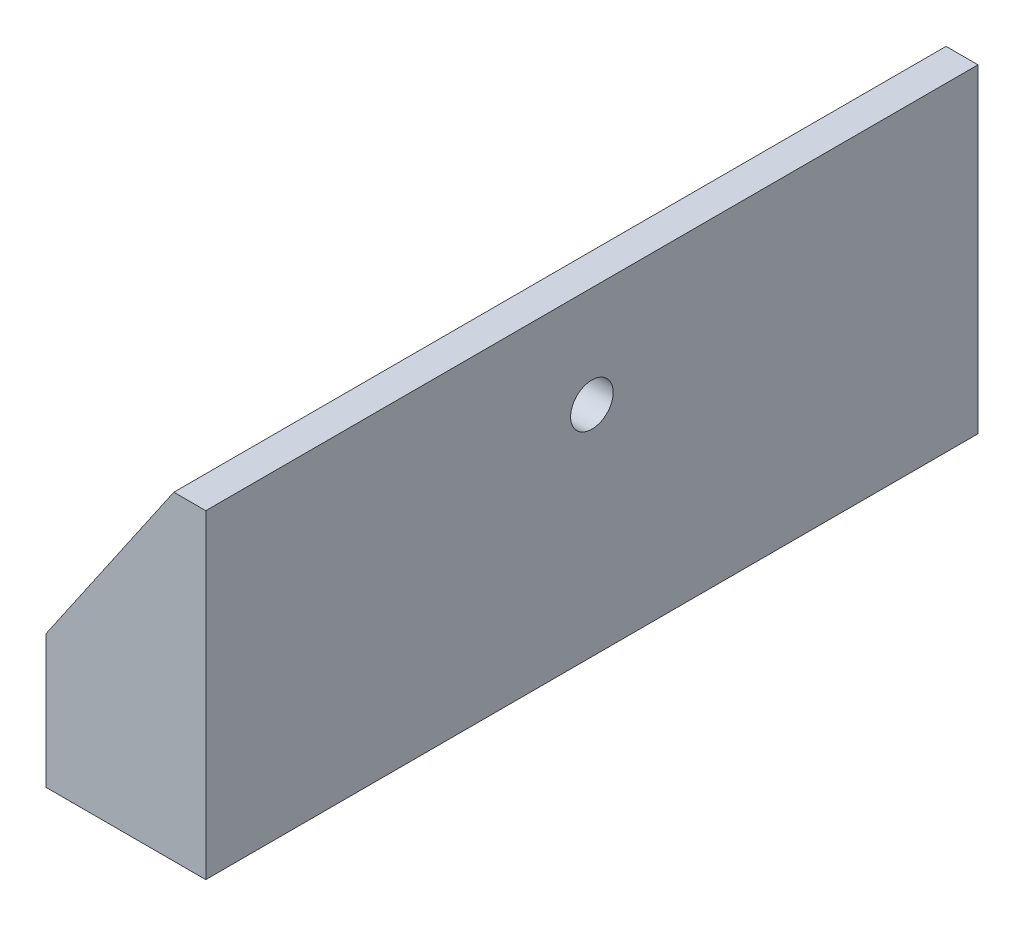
ISO-10303-21;
HEADER;
FILE_DESCRIPTION(('STEP AP214'),'2;1');
FILE_NAME('part.step','',(''),(''),'','','');
FILE_SCHEMA(('AUTOMOTIVE_DESIGN { 1 0 10303 214 1 1 1 1 }'));
ENDSEC;
DATA;
#1=APPLICATION_CONTEXT('core data for automotive mechanical design processes');
#2=APPLICATION_PROTOCOL_DEFINITION('international standard','automotive_design',2000,#1);
#3=PRODUCT_CONTEXT('',#1,'mechanical');
#4=PRODUCT('Part','Part','',(#3));
#5=PRODUCT_RELATED_PRODUCT_CATEGORY('part','',(#4));
#6=PRODUCT_DEFINITION_FORMATION('','',#4);
#7=PRODUCT_DEFINITION_CONTEXT('part definition',#1,'design');
#8=PRODUCT_DEFINITION('design','',#6,#7);
#9=PRODUCT_DEFINITION_SHAPE('','',#8);
#10=(LENGTH_UNIT() NAMED_UNIT(*) SI_UNIT(.MILLI.,.METRE.));
#11=(NAMED_UNIT(*) PLANE_ANGLE_UNIT() SI_UNIT($,.RADIAN.));
#12=(NAMED_UNIT(*) SI_UNIT($,.STERADIAN.) SOLID_ANGLE_UNIT());
#13=UNCERTAINTY_MEASURE_WITH_UNIT(LENGTH_MEASURE(1.E-05),#10,'distance_accuracy_value','');
#14=(GEOMETRIC_REPRESENTATION_CONTEXT(3) GLOBAL_UNCERTAINTY_ASSIGNED_CONTEXT((#13)) GLOBAL_UNIT_ASSIGNED_CONTEXT((#10,
#11,#12)) REPRESENTATION_CONTEXT('',''));
#15=CARTESIAN_POINT('',(0.,0.,0.));
#16=DIRECTION('',(0.,0.,1.));
#17=DIRECTION('',(1.,0.,0.));
#18=AXIS2_PLACEMENT_3D('',#15,#16,#17);
#19=CARTESIAN_POINT('',(-7.5,-15.,-36.25));
#20=DIRECTION('',(0.,-1.,0.));
#21=DIRECTION('',(0.,0.,-1.));
#22=AXIS2_PLACEMENT_3D('',#19,#20,#21);
#23=PLANE('',#22);
#24=DIRECTION('',(1.,0.,0.));
#25=VECTOR('',#24,1.);
#26=CARTESIAN_POINT('',(-7.5,-15.,36.25));
#27=LINE('',#26,#25);
#28=CARTESIAN_POINT('',(-7.5,-15.,36.25));
#29=VERTEX_POINT('',#28);
#30=CARTESIAN_POINT('',(7.5,-15.,36.25));
#31=VERTEX_POINT('',#30);
#32=EDGE_CURVE('E109',#29,#31,#27,.T.);
#33=ORIENTED_EDGE('',*,*,#32,.F.);
#34=DIRECTION('',(0.,0.,1.));
#35=VECTOR('',#34,1.);
#36=CARTESIAN_POINT('',(-7.5,-15.,-36.25));
#37=LINE('',#36,#35);
#38=CARTESIAN_POINT('',(-7.5,-15.,-36.25));
#39=VERTEX_POINT('',#38);
#40=EDGE_CURVE('E11',#39,#29,#37,.T.);
#41=ORIENTED_EDGE('',*,*,#40,.F.);
#42=DIRECTION('',(1.,0.,0.));
#43=VECTOR('',#42,1.);
#44=CARTESIAN_POINT('',(-7.5,-15.,-36.25));
#45=LINE('',#44,#43);
#46=CARTESIAN_POINT('',(7.5,-15.,-36.25));
#47=VERTEX_POINT('',#46);
#48=EDGE_CURVE('E104',#39,#47,#45,.T.);
#49=ORIENTED_EDGE('',*,*,#48,.T.);
#50=DIRECTION('',(0.,0.,1.));
#51=VECTOR('',#50,1.);
#52=CARTESIAN_POINT('',(7.5,-15.,-36.25));
#53=LINE('',#52,#51);
#54=EDGE_CURVE('E35',#47,#31,#53,.T.);
#55=ORIENTED_EDGE('',*,*,#54,.T.);
#56=EDGE_LOOP('',(#33,#41,#49,#55));
#57=FACE_BOUND('',#56,.T.);
#58=ADVANCED_FACE('F32',(#57),#23,.T.);
#59=CARTESIAN_POINT('',(-7.49999999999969,-2.50000000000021,-36.25));
#60=DIRECTION('',(-1.,0.,0.));
#61=DIRECTION('',(0.,-1.,0.));
#62=AXIS2_PLACEMENT_3D('',#59,#60,#61);
#63=PLANE('',#62);
#64=DIRECTION('',(0.,-1.,0.));
#65=VECTOR('',#64,1.);
#66=CARTESIAN_POINT('',(-7.49999999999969,-2.50000000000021,36.25));
#67=LINE('',#66,#65);
#68=CARTESIAN_POINT('',(-7.49999999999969,-2.50000000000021,36.25));
#69=VERTEX_POINT('',#68);
#70=EDGE_CURVE('E119',#69,#29,#67,.T.);
#71=ORIENTED_EDGE('',*,*,#70,.F.);
#72=DIRECTION('',(0.,0.,1.));
#73=VECTOR('',#72,1.);
#74=CARTESIAN_POINT('',(-7.49999999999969,-2.50000000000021,-36.25));
#75=LINE('',#74,#73);
#76=CARTESIAN_POINT('',(-7.49999999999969,-2.50000000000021,-36.25));
#77=VERTEX_POINT('',#76);
#78=EDGE_CURVE('E41',#77,#69,#75,.T.);
#79=ORIENTED_EDGE('',*,*,#78,.F.);
#80=DIRECTION('',(0.,-1.,0.));
#81=VECTOR('',#80,1.);
#82=CARTESIAN_POINT('',(-7.49999999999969,-2.50000000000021,-36.25));
#83=LINE('',#82,#81);
#84=EDGE_CURVE('E99',#77,#39,#83,.T.);
#85=ORIENTED_EDGE('',*,*,#84,.T.);
#86=ORIENTED_EDGE('',*,*,#40,.T.);
#87=EDGE_LOOP('',(#71,#79,#85,#86));
#88=FACE_BOUND('',#87,.T.);
#89=ADVANCED_FACE('F125',(#88),#63,.T.);
#90=CARTESIAN_POINT('',(4.5,15.,-36.25));
#91=DIRECTION('',(-0.824728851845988,0.565528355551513,0.));
#92=DIRECTION('',(-0.565528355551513,-0.824728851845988,0.));
#93=AXIS2_PLACEMENT_3D('',#90,#91,#92);
#94=PLANE('',#93);
#95=CARTESIAN_POINT('',(-2.01428571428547,5.5,0.));
#96=DIRECTION('',(-0.824728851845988,0.565528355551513,0.));
#97=DIRECTION('',(0.565528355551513,0.824728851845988,0.));
#98=AXIS2_PLACEMENT_3D('',#95,#96,#97);
#99=ELLIPSE('',#98,2.42503944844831,2.);
#100=CARTESIAN_POINT('',(-0.642857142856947,7.5,0.));
#101=VERTEX_POINT('',#100);
#102=EDGE_CURVE('E113',#101,#101,#99,.T.);
#103=ORIENTED_EDGE('',*,*,#102,.F.);
#104=EDGE_LOOP('',(#103));
#105=FACE_BOUND('',#104,.T.);
#106=DIRECTION('',(-0.565528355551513,-0.824728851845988,0.));
#107=VECTOR('',#106,1.);
#108=CARTESIAN_POINT('',(4.5,15.,36.25));
#109=LINE('',#108,#107);
#110=CARTESIAN_POINT('',(4.5,15.,36.25));
#111=VERTEX_POINT('',#110);
#112=EDGE_CURVE('E88',#111,#69,#109,.T.);
#113=ORIENTED_EDGE('',*,*,#112,.F.);
#114=DIRECTION('',(0.,0.,1.));
#115=VECTOR('',#114,1.);
#116=CARTESIAN_POINT('',(4.5,15.,-36.25));
#117=LINE('',#116,#115);
#118=CARTESIAN_POINT('',(4.5,15.,-36.25));
#119=VERTEX_POINT('',#118);
#120=EDGE_CURVE('E83',#119,#111,#117,.T.);
#121=ORIENTED_EDGE('',*,*,#120,.F.);
#122=DIRECTION('',(-0.565528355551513,-0.824728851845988,0.));
#123=VECTOR('',#122,1.);
#124=CARTESIAN_POINT('',(4.5,15.,-36.25));
#125=LINE('',#124,#123);
#126=EDGE_CURVE('E86',#119,#77,#125,.T.);
#127=ORIENTED_EDGE('',*,*,#126,.T.);
#128=ORIENTED_EDGE('',*,*,#78,.T.);
#129=EDGE_LOOP('',(#113,#121,#127,#128));
#130=FACE_BOUND('',#129,.T.);
#131=ADVANCED_FACE('F85',(#105,#130),#94,.T.);
#132=CARTESIAN_POINT('',(7.5,15.,-36.25));
#133=DIRECTION('',(0.,1.,0.));
#134=DIRECTION('',(0.,0.,1.));
#135=AXIS2_PLACEMENT_3D('',#132,#133,#134);
#136=PLANE('',#135);
#137=DIRECTION('',(-1.,0.,0.));
#138=VECTOR('',#137,1.);
#139=CARTESIAN_POINT('',(7.5,15.,36.25));
#140=LINE('',#139,#138);
#141=CARTESIAN_POINT('',(7.5,15.,36.25));
#142=VERTEX_POINT('',#141);
#143=EDGE_CURVE('E116',#142,#111,#140,.T.);
#144=ORIENTED_EDGE('',*,*,#143,.F.);
#145=DIRECTION('',(0.,0.,1.));
#146=VECTOR('',#145,1.);
#147=CARTESIAN_POINT('',(7.5,15.,-36.25));
#148=LINE('',#147,#146);
#149=CARTESIAN_POINT('',(7.5,15.,-36.25));
#150=VERTEX_POINT('',#149);
#151=EDGE_CURVE('E93',#150,#142,#148,.T.);
#152=ORIENTED_EDGE('',*,*,#151,.F.);
#153=DIRECTION('',(-1.,0.,0.));
#154=VECTOR('',#153,1.);
#155=CARTESIAN_POINT('',(7.5,15.,-36.25));
#156=LINE('',#155,#154);
#157=EDGE_CURVE('E98',#150,#119,#156,.T.);
#158=ORIENTED_EDGE('',*,*,#157,.T.);
#159=ORIENTED_EDGE('',*,*,#120,.T.);
#160=EDGE_LOOP('',(#144,#152,#158,#159));
#161=FACE_BOUND('',#160,.T.);
#162=ADVANCED_FACE('F101',(#161),#136,.T.);
#163=CARTESIAN_POINT('',(7.5,-15.,-36.25));
#164=DIRECTION('',(1.,0.,0.));
#165=DIRECTION('',(0.,0.,-1.));
#166=AXIS2_PLACEMENT_3D('',#163,#164,#165);
#167=PLANE('',#166);
#168=CARTESIAN_POINT('',(7.5,5.5,0.));
#169=DIRECTION('',(1.,0.,0.));
#170=DIRECTION('',(0.,0.,-1.));
#171=AXIS2_PLACEMENT_3D('',#168,#169,#170);
#172=CIRCLE('',#171,2.);
#173=CARTESIAN_POINT('',(7.5,5.5,-2.));
#174=VERTEX_POINT('',#173);
#175=EDGE_CURVE('E147',#174,#174,#172,.T.);
#176=ORIENTED_EDGE('',*,*,#175,.F.);
#177=EDGE_LOOP('',(#176));
#178=FACE_BOUND('',#177,.T.);
#179=DIRECTION('',(0.,1.,0.));
#180=VECTOR('',#179,1.);
#181=CARTESIAN_POINT('',(7.5,-15.,36.25));
#182=LINE('',#181,#180);
#183=EDGE_CURVE('E112',#31,#142,#182,.T.);
#184=ORIENTED_EDGE('',*,*,#183,.F.);
#185=ORIENTED_EDGE('',*,*,#54,.F.);
#186=DIRECTION('',(0.,1.,0.));
#187=VECTOR('',#186,1.);
#188=CARTESIAN_POINT('',(7.5,-15.,-36.25));
#189=LINE('',#188,#187);
#190=EDGE_CURVE('E102',#47,#150,#189,.T.);
#191=ORIENTED_EDGE('',*,*,#190,.T.);
#192=ORIENTED_EDGE('',*,*,#151,.T.);
#193=EDGE_LOOP('',(#184,#185,#191,#192));
#194=FACE_BOUND('',#193,.T.);
#195=ADVANCED_FACE('F122',(#178,#194),#167,.T.);
#196=CARTESIAN_POINT('',(0.,0.,-36.25));
#197=DIRECTION('',(0.,0.,1.));
#198=DIRECTION('',(1.,0.,0.));
#199=AXIS2_PLACEMENT_3D('',#196,#197,#198);
#200=PLANE('',#199);
#201=ORIENTED_EDGE('',*,*,#48,.F.);
#202=ORIENTED_EDGE('',*,*,#84,.F.);
#203=ORIENTED_EDGE('',*,*,#126,.F.);
#204=ORIENTED_EDGE('',*,*,#157,.F.);
#205=ORIENTED_EDGE('',*,*,#190,.F.);
#206=EDGE_LOOP('',(#201,#202,#203,#204,#205));
#207=FACE_BOUND('',#206,.T.);
#208=ADVANCED_FACE('F97',(#207),#200,.F.);
#209=CARTESIAN_POINT('',(0.,0.,36.25));
#210=DIRECTION('',(0.,0.,1.));
#211=DIRECTION('',(1.,0.,0.));
#212=AXIS2_PLACEMENT_3D('',#209,#210,#211);
#213=PLANE('',#212);
#214=ORIENTED_EDGE('',*,*,#32,.T.);
#215=ORIENTED_EDGE('',*,*,#183,.T.);
#216=ORIENTED_EDGE('',*,*,#143,.T.);
#217=ORIENTED_EDGE('',*,*,#112,.T.);
#218=ORIENTED_EDGE('',*,*,#70,.T.);
#219=EDGE_LOOP('',(#214,#215,#216,#217,#218));
#220=FACE_BOUND('',#219,.T.);
#221=ADVANCED_FACE('F124',(#220),#213,.T.);
#222=CARTESIAN_POINT('',(-7.5,5.5,0.));
#223=DIRECTION('',(1.,0.,0.));
#224=DIRECTION('',(0.,0.,-1.));
#225=AXIS2_PLACEMENT_3D('',#222,#223,#224);
#226=CYLINDRICAL_SURFACE('',#225,2.);
#227=ORIENTED_EDGE('',*,*,#102,.T.);
#228=EDGE_LOOP('',(#227));
#229=FACE_BOUND('',#228,.T.);
#230=ORIENTED_EDGE('',*,*,#175,.T.);
#231=EDGE_LOOP('',(#230));
#232=FACE_BOUND('',#231,.T.);
#233=ADVANCED_FACE('F154',(#229,#232),#226,.F.);
#234=CLOSED_SHELL('',(#58,#89,#131,#162,#195,#208,#221,#233));
#235=MANIFOLD_SOLID_BREP('B2',#234);
#236=ADVANCED_BREP_SHAPE_REPRESENTATION('',(#18,#235),#14);
#237=SHAPE_DEFINITION_REPRESENTATION(#9,#236);
ENDSEC;
END-ISO-10303-21;
